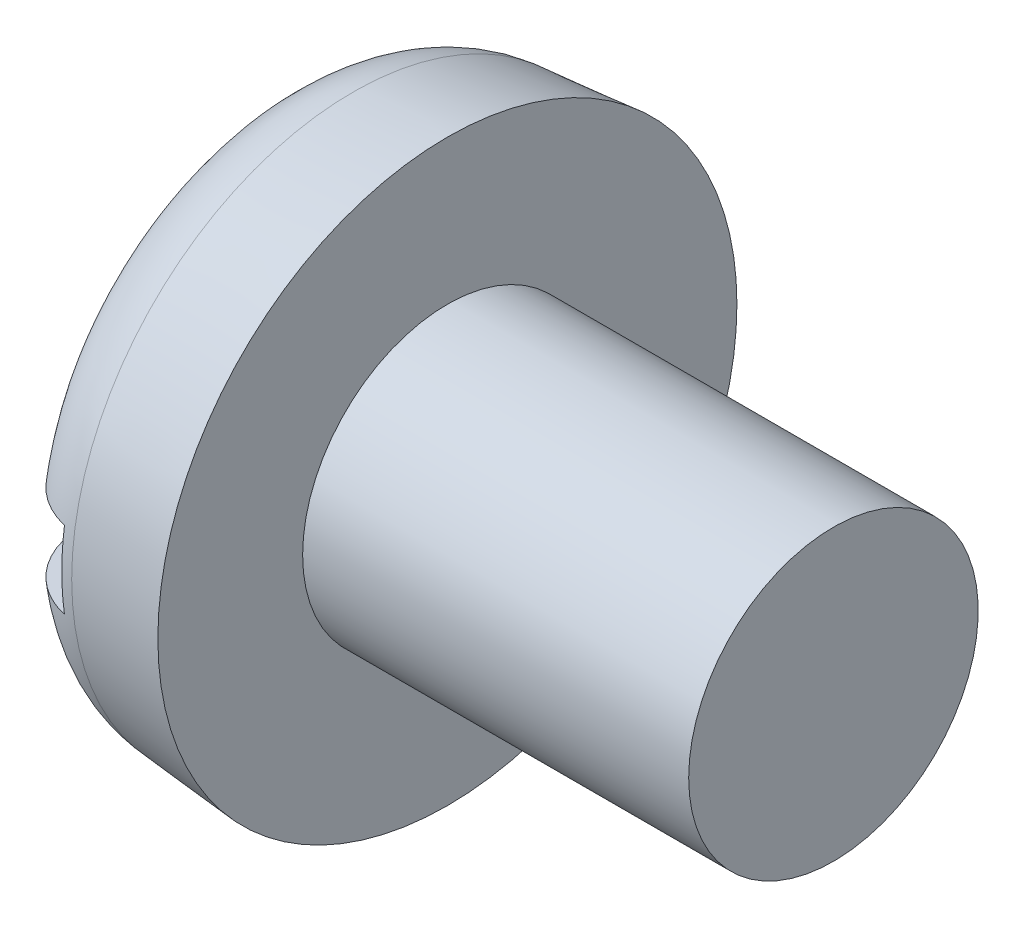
ISO-10303-21;
HEADER;
FILE_DESCRIPTION(('STEP AP214'),'2;1');
FILE_NAME('part.step','',(''),(''),'','','');
FILE_SCHEMA(('AUTOMOTIVE_DESIGN { 1 0 10303 214 1 1 1 1 }'));
ENDSEC;
DATA;
#1=APPLICATION_CONTEXT('core data for automotive mechanical design processes');
#2=APPLICATION_PROTOCOL_DEFINITION('international standard','automotive_design',2000,#1);
#3=PRODUCT_CONTEXT('',#1,'mechanical');
#4=PRODUCT('Part','Part','',(#3));
#5=PRODUCT_RELATED_PRODUCT_CATEGORY('part','',(#4));
#6=PRODUCT_DEFINITION_FORMATION('','',#4);
#7=PRODUCT_DEFINITION_CONTEXT('part definition',#1,'design');
#8=PRODUCT_DEFINITION('design','',#6,#7);
#9=PRODUCT_DEFINITION_SHAPE('','',#8);
#10=(LENGTH_UNIT() NAMED_UNIT(*) SI_UNIT(.MILLI.,.METRE.));
#11=(NAMED_UNIT(*) PLANE_ANGLE_UNIT() SI_UNIT($,.RADIAN.));
#12=(NAMED_UNIT(*) SI_UNIT($,.STERADIAN.) SOLID_ANGLE_UNIT());
#13=UNCERTAINTY_MEASURE_WITH_UNIT(LENGTH_MEASURE(1.E-05),#10,'distance_accuracy_value','');
#14=(GEOMETRIC_REPRESENTATION_CONTEXT(3) GLOBAL_UNCERTAINTY_ASSIGNED_CONTEXT((#13)) GLOBAL_UNIT_ASSIGNED_CONTEXT((#10,
#11,#12)) REPRESENTATION_CONTEXT('',''));
#15=CARTESIAN_POINT('',(0.,0.,0.));
#16=DIRECTION('',(0.,0.,1.));
#17=DIRECTION('',(1.,0.,0.));
#18=AXIS2_PLACEMENT_3D('',#15,#16,#17);
#19=CARTESIAN_POINT('',(0.,0.,0.));
#20=DIRECTION('',(-1.,0.,0.));
#21=DIRECTION('',(0.,0.,1.));
#22=AXIS2_PLACEMENT_3D('',#19,#20,#21);
#23=PLANE('',#22);
#24=DIRECTION('',(0.,0.,-1.));
#25=VECTOR('',#24,1.);
#26=CARTESIAN_POINT('',(0.,0.799999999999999,6.));
#27=LINE('',#26,#25);
#28=CARTESIAN_POINT('',(0.,0.799999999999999,3.9555566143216));
#29=VERTEX_POINT('',#28);
#30=CARTESIAN_POINT('',(0.,0.799999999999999,-3.9555566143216));
#31=VERTEX_POINT('',#30);
#32=EDGE_CURVE('E85',#29,#31,#27,.T.);
#33=ORIENTED_EDGE('',*,*,#32,.F.);
#34=CARTESIAN_POINT('',(0.,0.,0.));
#35=DIRECTION('',(-1.,0.,0.));
#36=DIRECTION('',(0.,0.,1.));
#37=AXIS2_PLACEMENT_3D('',#34,#35,#36);
#38=CIRCLE('',#37,4.03564469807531);
#39=EDGE_CURVE('E91',#29,#31,#38,.T.);
#40=ORIENTED_EDGE('',*,*,#39,.T.);
#41=EDGE_LOOP('',(#33,#40));
#42=FACE_BOUND('',#41,.T.);
#43=ADVANCED_FACE('F32',(#42),#23,.T.);
#44=CARTESIAN_POINT('',(-25.4,0.,0.));
#45=DIRECTION('',(-1.,0.,0.));
#46=DIRECTION('',(0.,0.,1.));
#47=AXIS2_PLACEMENT_3D('',#44,#45,#46);
#48=CYLINDRICAL_SURFACE('',#47,3.);
#49=CARTESIAN_POINT('',(11.6,0.,0.));
#50=DIRECTION('',(-1.,0.,0.));
#51=DIRECTION('',(0.,0.,1.));
#52=AXIS2_PLACEMENT_3D('',#49,#50,#51);
#53=CIRCLE('',#52,3.);
#54=CARTESIAN_POINT('',(11.6,0.,3.));
#55=VERTEX_POINT('',#54);
#56=EDGE_CURVE('E92',#55,#55,#53,.T.);
#57=ORIENTED_EDGE('',*,*,#56,.T.);
#58=EDGE_LOOP('',(#57));
#59=FACE_BOUND('',#58,.T.);
#60=CARTESIAN_POINT('',(3.6,0.,0.));
#61=DIRECTION('',(-1.,0.,0.));
#62=DIRECTION('',(0.,0.,1.));
#63=AXIS2_PLACEMENT_3D('',#60,#61,#62);
#64=CIRCLE('',#63,3.);
#65=CARTESIAN_POINT('',(3.6,0.,3.));
#66=VERTEX_POINT('',#65);
#67=EDGE_CURVE('E149',#66,#66,#64,.T.);
#68=ORIENTED_EDGE('',*,*,#67,.F.);
#69=EDGE_LOOP('',(#68));
#70=FACE_BOUND('',#69,.T.);
#71=ADVANCED_FACE('F137',(#59,#70),#48,.T.);
#72=CARTESIAN_POINT('',(11.6,3.,0.));
#73=DIRECTION('',(1.,0.,0.));
#74=DIRECTION('',(0.,0.,-1.));
#75=AXIS2_PLACEMENT_3D('',#72,#73,#74);
#76=PLANE('',#75);
#77=ORIENTED_EDGE('',*,*,#56,.F.);
#78=EDGE_LOOP('',(#77));
#79=FACE_BOUND('',#78,.T.);
#80=ADVANCED_FACE('F135',(#79),#76,.T.);
#81=DIRECTION('',(0.,0.,1.));
#82=VECTOR('',#81,1.);
#83=CARTESIAN_POINT('',(0.,-0.799999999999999,-6.));
#84=LINE('',#83,#82);
#85=CARTESIAN_POINT('',(0.,-0.799999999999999,-3.9555566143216));
#86=VERTEX_POINT('',#85);
#87=CARTESIAN_POINT('',(0.,-0.800000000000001,3.9555566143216));
#88=VERTEX_POINT('',#87);
#89=EDGE_CURVE('E76',#86,#88,#84,.T.);
#90=ORIENTED_EDGE('',*,*,#89,.F.);
#91=EDGE_CURVE('E83',#86,#88,#38,.T.);
#92=ORIENTED_EDGE('',*,*,#91,.T.);
#93=EDGE_LOOP('',(#90,#92));
#94=FACE_BOUND('',#93,.T.);
#95=ADVANCED_FACE('F82',(#94),#23,.T.);
#96=CARTESIAN_POINT('',(0.,0.,0.));
#97=DIRECTION('',(1.,0.,0.));
#98=DIRECTION('',(0.,0.,-1.));
#99=AXIS2_PLACEMENT_3D('',#96,#97,#98);
#100=CONICAL_SURFACE('',#99,5.68504081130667,0.0872664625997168);
#101=CARTESIAN_POINT('',(1.64311966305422,0.,0.));
#102=DIRECTION('',(-1.,0.,0.));
#103=DIRECTION('',(0.,0.,1.));
#104=AXIS2_PLACEMENT_3D('',#101,#102,#103);
#105=CIRCLE('',#104,5.82879515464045);
#106=CARTESIAN_POINT('',(1.64311966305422,0.,5.82879515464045));
#107=VERTEX_POINT('',#106);
#108=EDGE_CURVE('E95',#107,#107,#105,.F.);
#109=ORIENTED_EDGE('',*,*,#108,.T.);
#110=EDGE_LOOP('',(#109));
#111=FACE_BOUND('',#110,.T.);
#112=CARTESIAN_POINT('',(3.6,0.,0.));
#113=DIRECTION('',(-1.,0.,0.));
#114=DIRECTION('',(0.,0.,1.));
#115=AXIS2_PLACEMENT_3D('',#112,#113,#114);
#116=CIRCLE('',#115,6.);
#117=CARTESIAN_POINT('',(3.6,0.,6.));
#118=VERTEX_POINT('',#117);
#119=EDGE_CURVE('E97',#118,#118,#116,.T.);
#120=ORIENTED_EDGE('',*,*,#119,.T.);
#121=EDGE_LOOP('',(#120));
#122=FACE_BOUND('',#121,.T.);
#123=ADVANCED_FACE('F128',(#111,#122),#100,.T.);
#124=CARTESIAN_POINT('',(3.6,3.,0.));
#125=DIRECTION('',(-1.,0.,0.));
#126=DIRECTION('',(0.,0.,1.));
#127=AXIS2_PLACEMENT_3D('',#124,#125,#126);
#128=PLANE('',#127);
#129=ORIENTED_EDGE('',*,*,#119,.F.);
#130=EDGE_LOOP('',(#129));
#131=FACE_BOUND('',#130,.T.);
#132=ORIENTED_EDGE('',*,*,#67,.T.);
#133=EDGE_LOOP('',(#132));
#134=FACE_BOUND('',#133,.T.);
#135=ADVANCED_FACE('F124',(#131,#134),#128,.F.);
#136=CARTESIAN_POINT('',(1.8,0.,0.));
#137=DIRECTION('',(-1.,0.,0.));
#138=DIRECTION('',(0.,0.,1.));
#139=AXIS2_PLACEMENT_3D('',#136,#137,#138);
#140=TOROIDAL_SURFACE('',#139,4.03564469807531,1.8);
#141=CARTESIAN_POINT('',(0.540762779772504,0.799999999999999,-5.2613759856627));
#142=CARTESIAN_POINT('',(0.612348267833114,0.799999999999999,-5.33226007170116));
#143=CARTESIAN_POINT('',(0.689931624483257,0.799999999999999,-5.3971854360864));
#144=CARTESIAN_POINT('',(0.854947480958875,0.799999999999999,-5.51316161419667));
#145=CARTESIAN_POINT('',(0.94239068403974,0.799999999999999,-5.56419714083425));
#146=CARTESIAN_POINT('',(1.12461220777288,0.799999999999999,-5.650821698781));
#147=CARTESIAN_POINT('',(1.21938917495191,0.799999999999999,-5.6864135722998));
#148=CARTESIAN_POINT('',(1.41356630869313,0.799999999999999,-5.74109194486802));
#149=CARTESIAN_POINT('',(1.51296538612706,0.799999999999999,-5.76018231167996));
#150=CARTESIAN_POINT('',(1.71313899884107,0.799999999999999,-5.78126121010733));
#151=CARTESIAN_POINT('',(1.81390602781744,0.799999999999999,-5.78332104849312));
#152=CARTESIAN_POINT('',(2.01435310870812,0.799999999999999,-5.77046455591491));
#153=CARTESIAN_POINT('',(2.11403314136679,0.799999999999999,-5.75554792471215));
#154=CARTESIAN_POINT('',(2.309314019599,0.799999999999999,-5.70921606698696));
#155=CARTESIAN_POINT('',(2.40492104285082,0.799999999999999,-5.67782686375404));
#156=CARTESIAN_POINT('',(2.58952927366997,0.799999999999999,-5.59948776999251));
#157=CARTESIAN_POINT('',(2.67853045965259,0.799999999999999,-5.55253782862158));
#158=CARTESIAN_POINT('',(2.84769451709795,0.799999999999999,-5.44428887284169));
#159=CARTESIAN_POINT('',(2.92783091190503,0.799999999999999,-5.38294849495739));
#160=CARTESIAN_POINT('',(3.07676159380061,0.799999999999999,-5.24777626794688));
#161=CARTESIAN_POINT('',(3.1455556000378,0.799999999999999,-5.17394410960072));
#162=CARTESIAN_POINT('',(3.27042510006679,0.799999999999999,-5.01531035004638));
#163=CARTESIAN_POINT('',(3.32640120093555,0.799999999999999,-4.93043053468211));
#164=CARTESIAN_POINT('',(3.4235057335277,0.799999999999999,-4.75256933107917));
#165=CARTESIAN_POINT('',(3.46463341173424,0.799999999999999,-4.65958753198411));
#166=CARTESIAN_POINT('',(3.53144158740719,0.799999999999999,-4.46694835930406));
#167=CARTESIAN_POINT('',(3.55692557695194,0.799999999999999,-4.36722286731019));
#168=CARTESIAN_POINT('',(3.59108701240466,0.799999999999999,-4.16493761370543));
#169=CARTESIAN_POINT('',(3.59976314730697,0.799999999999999,-4.06237763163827));
#170=CARTESIAN_POINT('',(3.60023112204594,0.799999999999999,-3.85550711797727));
#171=CARTESIAN_POINT('',(3.59173848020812,0.799999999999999,-3.75119596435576));
#172=CARTESIAN_POINT('',(3.55768438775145,0.799999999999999,-3.54539907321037));
#173=CARTESIAN_POINT('',(3.53212117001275,0.799999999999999,-3.44391362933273));
#174=CARTESIAN_POINT('',(3.46412322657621,0.799999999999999,-3.24471369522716));
#175=CARTESIAN_POINT('',(3.42139292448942,0.799999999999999,-3.14710004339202));
#176=CARTESIAN_POINT('',(3.32030286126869,0.799999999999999,-2.96031799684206));
#177=CARTESIAN_POINT('',(3.26194098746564,0.799999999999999,-2.87115074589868));
#178=CARTESIAN_POINT('',(3.13053846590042,0.799999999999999,-2.70303664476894));
#179=CARTESIAN_POINT('',(3.05736818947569,0.799999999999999,-2.62419095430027));
#180=CARTESIAN_POINT('',(2.89859048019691,0.799999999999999,-2.48017518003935));
#181=CARTESIAN_POINT('',(2.81298317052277,0.799999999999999,-2.41500496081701));
#182=CARTESIAN_POINT('',(2.6334271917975,0.799999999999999,-2.30187272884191));
#183=CARTESIAN_POINT('',(2.53967929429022,0.799999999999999,-2.25359299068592));
#184=CARTESIAN_POINT('',(2.34507363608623,0.799999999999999,-2.17455467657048));
#185=CARTESIAN_POINT('',(2.24421969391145,0.799999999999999,-2.14378676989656));
#186=CARTESIAN_POINT('',(2.04443930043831,0.799999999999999,-2.10254396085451));
#187=CARTESIAN_POINT('',(1.94573097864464,0.799999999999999,-2.09101175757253));
#188=CARTESIAN_POINT('',(1.74783816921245,0.799999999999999,-2.08550669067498));
#189=CARTESIAN_POINT('',(1.64865381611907,0.799999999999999,-2.09152912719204));
#190=CARTESIAN_POINT('',(1.45702700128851,0.799999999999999,-2.12018138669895));
#191=CARTESIAN_POINT('',(1.36447664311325,0.799999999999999,-2.14209986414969));
#192=CARTESIAN_POINT('',(1.18420660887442,0.799999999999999,-2.20075771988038));
#193=CARTESIAN_POINT('',(1.09648771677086,0.799999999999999,-2.23749949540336));
#194=CARTESIAN_POINT('',(0.925723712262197,0.799999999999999,-2.32557805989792));
#195=CARTESIAN_POINT('',(0.842868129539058,0.799999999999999,-2.37728131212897));
#196=CARTESIAN_POINT('',(0.686362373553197,0.799999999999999,-2.493116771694));
#197=CARTESIAN_POINT('',(0.612714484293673,0.799999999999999,-2.55725205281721));
#198=CARTESIAN_POINT('',(0.472161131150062,0.799999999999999,-2.70027682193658));
#199=CARTESIAN_POINT('',(0.405916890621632,0.799999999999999,-2.77981681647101));
#200=CARTESIAN_POINT('',(0.287173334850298,0.799999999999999,-2.9485732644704));
#201=CARTESIAN_POINT('',(0.234676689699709,0.799999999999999,-3.03779159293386));
#202=CARTESIAN_POINT('',(0.143214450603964,0.799999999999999,-3.22677844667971));
#203=CARTESIAN_POINT('',(0.104782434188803,0.799999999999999,-3.32680584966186));
#204=CARTESIAN_POINT('',(0.0452446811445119,0.799999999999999,-3.5318922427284));
#205=CARTESIAN_POINT('',(0.0241387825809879,0.799999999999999,-3.63695118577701));
#206=CARTESIAN_POINT('',(-1.12670491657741E-05,0.799999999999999,-3.84916824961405));
#207=CARTESIAN_POINT('',(-0.00304965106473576,0.799999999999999,-3.95632702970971));
#208=CARTESIAN_POINT('',(0.00921984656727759,0.799999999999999,-4.16962319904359));
#209=CARTESIAN_POINT('',(0.0245310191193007,0.799999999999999,-4.27576040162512));
#210=CARTESIAN_POINT('',(0.0728327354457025,0.799999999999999,-4.48216521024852));
#211=CARTESIAN_POINT('',(0.105541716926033,0.799999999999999,-4.58249883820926));
#212=CARTESIAN_POINT('',(0.187634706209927,0.799999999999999,-4.77599767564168));
#213=CARTESIAN_POINT('',(0.236996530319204,0.799999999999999,-4.86917222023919));
#214=CARTESIAN_POINT('',(0.329466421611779,0.799999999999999,-5.01228034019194));
#215=CARTESIAN_POINT('',(0.367921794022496,0.799999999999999,-5.06527765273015));
#216=CARTESIAN_POINT('',(0.450329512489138,0.799999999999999,-5.16681267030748));
#217=CARTESIAN_POINT('',(0.494281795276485,0.799999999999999,-5.21535042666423));
#218=CARTESIAN_POINT('',(0.540762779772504,0.799999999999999,-5.2613759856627));
#219=B_SPLINE_CURVE_WITH_KNOTS('',3,(#141,#142,#143,#144,#145,#146,#147,#148,#149,#150,#151,
#152,#153,#154,#155,#156,#157,#158,#159,#160,#161,#162,#163,#164,#165,#166,#167,#168,#169,#170,
#171,#172,#173,#174,#175,#176,#177,#178,#179,#180,#181,#182,#183,#184,#185,#186,#187,#188,#189,
#190,#191,#192,#193,#194,#195,#196,#197,#198,#199,#200,#201,#202,#203,#204,#205,#206,#207,#208,
#209,#210,#211,#212,#213,#214,#215,#216,#217,#218),.UNSPECIFIED.,.T.,.F.,(4,2,2,2,2,2,2,2,2,2,2,
2,2,2,2,2,2,2,2,2,2,2,2,2,2,2,2,2,2,2,2,2,2,2,2,2,2,2,4),(0.,0.301990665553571,
0.604312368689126,0.906578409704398,1.20877358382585,1.50970282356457,1.81063738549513,
2.11109795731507,2.41155951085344,2.71289551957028,3.01423898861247,3.31784547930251,
3.6214673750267,3.92882908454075,4.23621476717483,4.54873547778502,4.86128854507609,
5.17947093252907,5.49769634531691,5.81883829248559,6.13997705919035,6.45470120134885,
6.76925749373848,7.06587349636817,7.36241009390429,7.64643650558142,7.93050886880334,
8.22223277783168,8.51402890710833,8.8231740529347,9.13237919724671,9.45232886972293,
9.77227555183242,10.0923243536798,10.4124305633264,10.7275071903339,11.042165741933,
11.2382527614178,11.4343375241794),.UNSPECIFIED.);
#220=CARTESIAN_POINT('',(1.4,0.799999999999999,-5.73510972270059));
#221=VERTEX_POINT('',#220);
#222=EDGE_CURVE('E11',#31,#221,#219,.T.);
#223=ORIENTED_EDGE('',*,*,#222,.F.);
#224=ORIENTED_EDGE('',*,*,#39,.F.);
#225=CARTESIAN_POINT('',(0.836266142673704,0.799999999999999,2.3847675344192));
#226=CARTESIAN_POINT('',(0.917616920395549,0.799999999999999,2.33037611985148));
#227=CARTESIAN_POINT('',(1.00338812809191,0.799999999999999,2.28250940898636));
#228=CARTESIAN_POINT('',(1.18171371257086,0.799999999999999,2.20157945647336));
#229=CARTESIAN_POINT('',(1.27427138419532,0.799999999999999,2.16852346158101));
#230=CARTESIAN_POINT('',(1.46387360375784,0.799999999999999,2.11861651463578));
#231=CARTESIAN_POINT('',(1.56092620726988,0.799999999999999,2.10179593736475));
#232=CARTESIAN_POINT('',(1.75645828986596,0.799999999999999,2.08531619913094));
#233=CARTESIAN_POINT('',(1.85493729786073,0.799999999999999,2.08565149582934));
#234=CARTESIAN_POINT('',(2.04724581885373,0.799999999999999,2.10316628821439));
#235=CARTESIAN_POINT('',(2.1411242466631,0.799999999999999,2.11981673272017));
#236=CARTESIAN_POINT('',(2.32483197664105,0.799999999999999,2.16840533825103));
#237=CARTESIAN_POINT('',(2.41466058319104,0.799999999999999,2.20034611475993));
#238=CARTESIAN_POINT('',(2.58937479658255,0.799999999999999,2.27883470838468));
#239=CARTESIAN_POINT('',(2.67416016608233,0.799999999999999,2.32560484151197));
#240=CARTESIAN_POINT('',(2.83527159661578,0.799999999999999,2.43194790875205));
#241=CARTESIAN_POINT('',(2.91159566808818,0.799999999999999,2.4915238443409));
#242=CARTESIAN_POINT('',(3.05833847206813,0.799999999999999,2.62557742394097));
#243=CARTESIAN_POINT('',(3.12814463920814,0.799999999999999,2.70072607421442));
#244=CARTESIAN_POINT('',(3.25476371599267,0.799999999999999,2.86127427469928));
#245=CARTESIAN_POINT('',(3.31157384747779,0.799999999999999,2.94667601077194));
#246=CARTESIAN_POINT('',(3.41282909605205,0.799999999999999,3.12914373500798));
#247=CARTESIAN_POINT('',(3.4566732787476,0.799999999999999,3.22654397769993));
#248=CARTESIAN_POINT('',(3.52749042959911,0.799999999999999,3.42730182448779));
#249=CARTESIAN_POINT('',(3.55446245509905,0.799999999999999,3.53065976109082));
#250=CARTESIAN_POINT('',(3.59074777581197,0.799999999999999,3.74099682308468));
#251=CARTESIAN_POINT('',(3.59996828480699,0.799999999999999,3.84799201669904));
#252=CARTESIAN_POINT('',(3.60003154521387,0.799999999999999,4.06199242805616));
#253=CARTESIAN_POINT('',(3.59087543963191,0.799999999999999,4.16899764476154));
#254=CARTESIAN_POINT('',(3.5545508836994,0.799999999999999,4.37828946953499));
#255=CARTESIAN_POINT('',(3.5276490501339,0.799999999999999,4.48062230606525));
#256=CARTESIAN_POINT('',(3.45672417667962,0.799999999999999,4.67917518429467));
#257=CARTESIAN_POINT('',(3.41270279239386,0.799999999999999,4.77539581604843));
#258=CARTESIAN_POINT('',(3.30967441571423,0.799999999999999,4.95711293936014));
#259=CARTESIAN_POINT('',(3.2509575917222,0.799999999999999,5.04277397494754));
#260=CARTESIAN_POINT('',(3.11977209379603,0.799999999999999,5.20282644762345));
#261=CARTESIAN_POINT('',(3.04730458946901,0.799999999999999,5.27721884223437));
#262=CARTESIAN_POINT('',(2.89186263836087,0.799999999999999,5.41145672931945));
#263=CARTESIAN_POINT('',(2.80906226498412,0.799999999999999,5.47150384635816));
#264=CARTESIAN_POINT('',(2.63447307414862,0.799999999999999,5.57667826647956));
#265=CARTESIAN_POINT('',(2.54268479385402,0.799999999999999,5.62180646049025));
#266=CARTESIAN_POINT('',(2.35372245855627,0.799999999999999,5.69541178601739));
#267=CARTESIAN_POINT('',(2.25661170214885,0.799999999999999,5.72405148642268));
#268=CARTESIAN_POINT('',(2.05894963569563,0.799999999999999,5.76452632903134));
#269=CARTESIAN_POINT('',(1.95839844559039,0.799999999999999,5.77636205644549));
#270=CARTESIAN_POINT('',(1.75726466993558,0.799999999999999,5.78286013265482));
#271=CARTESIAN_POINT('',(1.65668492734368,0.799999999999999,5.77761084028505));
#272=CARTESIAN_POINT('',(1.45783846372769,0.799999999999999,5.75028865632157));
#273=CARTESIAN_POINT('',(1.35957171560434,0.799999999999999,5.72821596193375));
#274=CARTESIAN_POINT('',(1.16819371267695,0.799999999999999,5.66791633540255));
#275=CARTESIAN_POINT('',(1.07507939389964,0.799999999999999,5.62969912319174));
#276=CARTESIAN_POINT('',(0.896555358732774,0.799999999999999,5.53823241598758));
#277=CARTESIAN_POINT('',(0.811145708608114,0.799999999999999,5.4849827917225));
#278=CARTESIAN_POINT('',(0.650082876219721,0.799999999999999,5.36476593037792));
#279=CARTESIAN_POINT('',(0.574468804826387,0.799999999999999,5.29774630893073));
#280=CARTESIAN_POINT('',(0.435451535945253,0.799999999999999,5.15205983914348));
#281=CARTESIAN_POINT('',(0.372048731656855,0.799999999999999,5.07339261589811));
#282=CARTESIAN_POINT('',(0.258650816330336,0.799999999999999,4.90594446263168));
#283=CARTESIAN_POINT('',(0.208774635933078,0.799999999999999,4.81708301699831));
#284=CARTESIAN_POINT('',(0.124428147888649,0.799999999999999,4.63233098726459));
#285=CARTESIAN_POINT('',(0.0899587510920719,0.799999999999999,4.53643998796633));
#286=CARTESIAN_POINT('',(0.0368868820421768,0.799999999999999,4.33899079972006));
#287=CARTESIAN_POINT('',(0.0185025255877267,0.799999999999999,4.23737401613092));
#288=CARTESIAN_POINT('',(-0.00125734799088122,0.799999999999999,4.03250747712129));
#289=CARTESIAN_POINT('',(-0.00263209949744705,0.799999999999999,3.9292576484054));
#290=CARTESIAN_POINT('',(0.0116307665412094,0.799999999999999,3.72214563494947));
#291=CARTESIAN_POINT('',(0.0275632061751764,0.799999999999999,3.61830377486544));
#292=CARTESIAN_POINT('',(0.0763335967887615,0.799999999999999,3.41464106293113));
#293=CARTESIAN_POINT('',(0.10917724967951,0.799999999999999,3.31482157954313));
#294=CARTESIAN_POINT('',(0.191511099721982,0.799999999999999,3.12021092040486));
#295=CARTESIAN_POINT('',(0.241286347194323,0.799999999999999,3.02554040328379));
#296=CARTESIAN_POINT('',(0.355915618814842,0.799999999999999,2.8458978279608));
#297=CARTESIAN_POINT('',(0.420755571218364,0.799999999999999,2.76091682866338));
#298=CARTESIAN_POINT('',(0.543269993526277,0.799999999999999,2.62572980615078));
#299=CARTESIAN_POINT('',(0.597683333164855,0.799999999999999,2.57253239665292));
#300=CARTESIAN_POINT('',(0.712598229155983,0.799999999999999,2.4731680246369));
#301=CARTESIAN_POINT('',(0.773099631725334,0.799999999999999,2.42700088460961));
#302=CARTESIAN_POINT('',(0.836266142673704,0.799999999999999,2.3847675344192));
#303=B_SPLINE_CURVE_WITH_KNOTS('',3,(#225,#226,#227,#228,#229,#230,#231,#232,#233,#234,#235,
#236,#237,#238,#239,#240,#241,#242,#243,#244,#245,#246,#247,#248,#249,#250,#251,#252,#253,#254,
#255,#256,#257,#258,#259,#260,#261,#262,#263,#264,#265,#266,#267,#268,#269,#270,#271,#272,#273,
#274,#275,#276,#277,#278,#279,#280,#281,#282,#283,#284,#285,#286,#287,#288,#289,#290,#291,#292,
#293,#294,#295,#296,#297,#298,#299,#300,#301,#302),.UNSPECIFIED.,.T.,.F.,(4,2,2,2,2,2,2,2,2,2,2,
2,2,2,2,2,2,2,2,2,2,2,2,2,2,2,2,2,2,2,2,2,2,2,2,2,2,2,4),(0.,0.293321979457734,
0.586787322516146,0.880800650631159,1.17471899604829,1.45941156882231,1.74415285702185,
2.03338255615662,2.32268012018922,2.62901646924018,2.93541824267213,3.25435495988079,
3.57330949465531,3.89392670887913,4.21452398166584,4.53041098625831,4.84626744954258,
5.1563211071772,5.46634840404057,5.77172128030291,6.0770759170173,6.37936593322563,
6.6816454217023,6.98236409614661,7.2830792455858,7.5836136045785,7.88415054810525,
8.18585270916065,8.48756458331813,8.79184901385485,9.09615143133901,9.40451898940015,
9.71290042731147,10.0266186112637,10.3404426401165,10.6598354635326,10.9789311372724,
11.2066928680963,11.43444884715),.UNSPECIFIED.);
#304=CARTESIAN_POINT('',(1.4,0.799999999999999,5.73510972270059));
#305=VERTEX_POINT('',#304);
#306=EDGE_CURVE('E109',#305,#29,#303,.T.);
#307=ORIENTED_EDGE('',*,*,#306,.F.);
#308=CARTESIAN_POINT('',(1.4,0.,0.));
#309=DIRECTION('',(-1.,0.,0.));
#310=DIRECTION('',(0.,0.,1.));
#311=AXIS2_PLACEMENT_3D('',#308,#309,#310);
#312=CIRCLE('',#311,5.79063757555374);
#313=CARTESIAN_POINT('',(1.4,-0.800000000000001,5.73510972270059));
#314=VERTEX_POINT('',#313);
#315=EDGE_CURVE('E103',#305,#314,#312,.F.);
#316=ORIENTED_EDGE('',*,*,#315,.T.);
#317=CARTESIAN_POINT('',(0.836266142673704,-0.8,2.3847675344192));
#318=CARTESIAN_POINT('',(0.748506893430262,-0.8,2.44345191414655));
#319=CARTESIAN_POINT('',(0.665766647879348,-0.8,2.50981960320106));
#320=CARTESIAN_POINT('',(0.512551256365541,-0.8,2.65561376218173));
#321=CARTESIAN_POINT('',(0.442099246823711,-0.8,2.73506432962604));
#322=CARTESIAN_POINT('',(0.315475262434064,-0.8,2.90443495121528));
#323=CARTESIAN_POINT('',(0.259280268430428,-0.8,2.99433778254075));
#324=CARTESIAN_POINT('',(0.162548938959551,-0.8,3.18215299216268));
#325=CARTESIAN_POINT('',(0.122006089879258,-0.8,3.28006201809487));
#326=CARTESIAN_POINT('',(0.0572425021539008,-0.8,3.4827212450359));
#327=CARTESIAN_POINT('',(0.0332676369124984,-0.8,3.58755021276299));
#328=CARTESIAN_POINT('',(0.00342578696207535,-0.8,3.79976969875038));
#329=CARTESIAN_POINT('',(-0.00244009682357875,-0.800000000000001,3.90716037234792));
#330=CARTESIAN_POINT('',(0.00425089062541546,-0.800000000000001,4.12040369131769));
#331=CARTESIAN_POINT('',(0.0166422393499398,-0.800000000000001,4.22626147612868));
#332=CARTESIAN_POINT('',(0.0593599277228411,-0.800000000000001,4.43429705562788));
#333=CARTESIAN_POINT('',(0.0896844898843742,-0.800000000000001,4.53647521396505));
#334=CARTESIAN_POINT('',(0.166811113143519,-0.800000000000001,4.73226366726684));
#335=CARTESIAN_POINT('',(0.21330327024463,-0.800000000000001,4.82599604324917));
#336=CARTESIAN_POINT('',(0.32162267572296,-0.800000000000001,5.00413844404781));
#337=CARTESIAN_POINT('',(0.383448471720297,-0.800000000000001,5.08854935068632));
#338=CARTESIAN_POINT('',(0.519544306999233,-0.800000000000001,5.24416143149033));
#339=CARTESIAN_POINT('',(0.593588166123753,-0.800000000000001,5.31556046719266));
#340=CARTESIAN_POINT('',(0.752739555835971,-0.800000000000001,5.44472836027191));
#341=CARTESIAN_POINT('',(0.837846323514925,-0.800000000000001,5.5024981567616));
#342=CARTESIAN_POINT('',(1.01558854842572,-0.800000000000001,5.60205300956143));
#343=CARTESIAN_POINT('',(1.10812041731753,-0.800000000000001,5.64402306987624));
#344=CARTESIAN_POINT('',(1.29895009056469,-0.800000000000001,5.71170590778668));
#345=CARTESIAN_POINT('',(1.39724763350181,-0.800000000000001,5.7374194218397));
#346=CARTESIAN_POINT('',(1.59606633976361,-0.800000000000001,5.77169733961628));
#347=CARTESIAN_POINT('',(1.69656671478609,-0.800000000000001,5.78038241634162));
#348=CARTESIAN_POINT('',(1.89759433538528,-0.800000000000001,5.78071120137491));
#349=CARTESIAN_POINT('',(1.99812158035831,-0.800000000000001,5.77235526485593));
#350=CARTESIAN_POINT('',(2.19609344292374,-0.800000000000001,5.73889133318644));
#351=CARTESIAN_POINT('',(2.29354498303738,-0.800000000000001,5.71382425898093));
#352=CARTESIAN_POINT('',(2.48286854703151,-0.800000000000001,5.64771711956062));
#353=CARTESIAN_POINT('',(2.57474056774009,-0.800000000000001,5.60667704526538));
#354=CARTESIAN_POINT('',(2.75051258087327,-0.800000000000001,5.50972539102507));
#355=CARTESIAN_POINT('',(2.8343959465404,-0.800000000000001,5.45378367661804));
#356=CARTESIAN_POINT('',(2.99165678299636,-0.800000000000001,5.32869697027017));
#357=CARTESIAN_POINT('',(3.06503402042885,-0.800000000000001,5.25955168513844));
#358=CARTESIAN_POINT('',(3.19973989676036,-0.800000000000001,5.10955333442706));
#359=CARTESIAN_POINT('',(3.26098586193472,-0.800000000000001,5.02862604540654));
#360=CARTESIAN_POINT('',(3.36919753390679,-0.800000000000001,4.85773374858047));
#361=CARTESIAN_POINT('',(3.41616259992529,-0.800000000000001,4.76776833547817));
#362=CARTESIAN_POINT('',(3.49507738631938,-0.800000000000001,4.5802716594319));
#363=CARTESIAN_POINT('',(3.52685014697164,-0.800000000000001,4.48266594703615));
#364=CARTESIAN_POINT('',(3.57383908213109,-0.800000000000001,4.28355151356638));
#365=CARTESIAN_POINT('',(3.58905405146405,-0.800000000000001,4.18204250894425));
#366=CARTESIAN_POINT('',(3.60277332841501,-0.800000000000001,3.97627512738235));
#367=CARTESIAN_POINT('',(3.60100695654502,-0.8,3.87199872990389));
#368=CARTESIAN_POINT('',(3.58032198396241,-0.8,3.66516328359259));
#369=CARTESIAN_POINT('',(3.56140169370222,-0.8,3.56260440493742));
#370=CARTESIAN_POINT('',(3.50655445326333,-0.8,3.3601262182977));
#371=CARTESIAN_POINT('',(3.47032341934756,-0.8,3.26028924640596));
#372=CARTESIAN_POINT('',(3.38182060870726,-0.8,3.06798854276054));
#373=CARTESIAN_POINT('',(3.32954675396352,-0.8,2.97552576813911));
#374=CARTESIAN_POINT('',(3.20964725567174,-0.8,2.79948120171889));
#375=CARTESIAN_POINT('',(3.14184223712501,-0.8,2.71602141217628));
#376=CARTESIAN_POINT('',(2.99302219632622,-0.8,2.56181483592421));
#377=CARTESIAN_POINT('',(2.91200632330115,-0.8,2.49106886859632));
#378=CARTESIAN_POINT('',(2.73997760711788,-0.8,2.36551639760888));
#379=CARTESIAN_POINT('',(2.64910309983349,-0.8,2.31052086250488));
#380=CARTESIAN_POINT('',(2.4590409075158,-0.8,2.21753014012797));
#381=CARTESIAN_POINT('',(2.35985743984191,-0.8,2.17952638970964));
#382=CARTESIAN_POINT('',(2.16147923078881,-0.8,2.12383562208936));
#383=CARTESIAN_POINT('',(2.06255196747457,-0.8,2.10519696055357));
#384=CARTESIAN_POINT('',(1.86294330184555,-0.8,2.08580594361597));
#385=CARTESIAN_POINT('',(1.76226208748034,-0.8,2.08505168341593));
#386=CARTESIAN_POINT('',(1.56749167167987,-0.8,2.1010369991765));
#387=CARTESIAN_POINT('',(1.47332742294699,-0.8,2.11688981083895));
#388=CARTESIAN_POINT('',(1.28901868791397,-0.8,2.16397488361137));
#389=CARTESIAN_POINT('',(1.19886974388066,-0.8,2.19518960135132));
#390=CARTESIAN_POINT('',(1.0638315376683,-0.8,2.25452352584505));
#391=CARTESIAN_POINT('',(1.01673933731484,-0.8,2.27777851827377));
#392=CARTESIAN_POINT('',(0.924773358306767,-0.8,2.32831196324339));
#393=CARTESIAN_POINT('',(0.879899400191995,-0.8,2.35559008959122));
#394=CARTESIAN_POINT('',(0.836266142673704,-0.8,2.3847675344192));
#395=B_SPLINE_CURVE_WITH_KNOTS('',3,(#317,#318,#319,#320,#321,#322,#323,#324,#325,#326,#327,
#328,#329,#330,#331,#332,#333,#334,#335,#336,#337,#338,#339,#340,#341,#342,#343,#344,#345,#346,
#347,#348,#349,#350,#351,#352,#353,#354,#355,#356,#357,#358,#359,#360,#361,#362,#363,#364,#365,
#366,#367,#368,#369,#370,#371,#372,#373,#374,#375,#376,#377,#378,#379,#380,#381,#382,#383,#384,
#385,#386,#387,#388,#389,#390,#391,#392,#393,#394),.UNSPECIFIED.,.T.,.F.,(4,2,2,2,2,2,2,2,2,2,2,
2,2,2,2,2,2,2,2,2,2,2,2,2,2,2,2,2,2,2,2,2,2,2,2,2,2,2,4),(0.,0.316518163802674,
0.633625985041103,0.950218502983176,1.2666791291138,1.58774070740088,1.90882180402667,
2.22700979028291,2.54516624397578,2.8575328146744,3.16986980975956,3.47696670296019,
3.78404242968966,4.08740155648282,4.39074693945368,4.69193476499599,4.99311631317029,
5.29356304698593,5.59400995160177,5.89506910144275,6.19613493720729,6.49918680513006,
6.80225226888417,7.10876667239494,7.41530338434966,7.72673423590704,8.03819576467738,
8.35534173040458,8.6725287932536,8.99358246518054,9.31465682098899,9.63169865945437,
9.94858054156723,10.2490245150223,10.549436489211,10.8345871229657,11.1194128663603,
11.276796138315,11.4341666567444),.UNSPECIFIED.);
#396=EDGE_CURVE('E90',#88,#314,#395,.T.);
#397=ORIENTED_EDGE('',*,*,#396,.F.);
#398=ORIENTED_EDGE('',*,*,#91,.F.);
#399=CARTESIAN_POINT('',(0.540762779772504,-0.799999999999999,-5.2613759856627));
#400=CARTESIAN_POINT('',(0.46800256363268,-0.799999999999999,-5.18931554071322));
#401=CARTESIAN_POINT('',(0.401331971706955,-0.799999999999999,-5.11098969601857));
#402=CARTESIAN_POINT('',(0.282092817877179,-0.799999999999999,-4.94415021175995));
#403=CARTESIAN_POINT('',(0.229543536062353,-0.799999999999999,-4.85562287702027));
#404=CARTESIAN_POINT('',(0.140058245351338,-0.799999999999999,-4.67111833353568));
#405=CARTESIAN_POINT('',(0.103104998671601,-0.799999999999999,-4.57514948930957));
#406=CARTESIAN_POINT('',(0.0456444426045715,-0.799999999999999,-4.37844736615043));
#407=CARTESIAN_POINT('',(0.0251330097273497,-0.799999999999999,-4.27771528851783));
#408=CARTESIAN_POINT('',(0.000807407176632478,-0.799999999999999,-4.07306902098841));
#409=CARTESIAN_POINT('',(-0.00280970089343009,-0.799999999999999,-3.96913144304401));
#410=CARTESIAN_POINT('',(0.00712688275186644,-0.799999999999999,-3.76207815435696));
#411=CARTESIAN_POINT('',(0.0206829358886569,-0.8,-3.65896255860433));
#412=CARTESIAN_POINT('',(0.0648595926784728,-0.8,-3.45448287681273));
#413=CARTESIAN_POINT('',(0.0957869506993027,-0.8,-3.35318504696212));
#414=CARTESIAN_POINT('',(0.173966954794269,-0.8,-3.15709227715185));
#415=CARTESIAN_POINT('',(0.221221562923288,-0.8,-3.06229812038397));
#416=CARTESIAN_POINT('',(0.331523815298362,-0.8,-2.8805427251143));
#417=CARTESIAN_POINT('',(0.394784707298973,-0.8,-2.79371074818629));
#418=CARTESIAN_POINT('',(0.535080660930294,-0.8,-2.63196239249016));
#419=CARTESIAN_POINT('',(0.612117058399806,-0.8,-2.5570471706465));
#420=CARTESIAN_POINT('',(0.777363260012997,-0.8,-2.42207446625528));
#421=CARTESIAN_POINT('',(0.865488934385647,-0.8,-2.36191424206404));
#422=CARTESIAN_POINT('',(1.05097305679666,-0.8,-2.25807126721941));
#423=CARTESIAN_POINT('',(1.1483280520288,-0.8,-2.21438238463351));
#424=CARTESIAN_POINT('',(1.34472607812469,-0.8,-2.14709500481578));
#425=CARTESIAN_POINT('',(1.44348146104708,-0.8,-2.12265879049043));
#426=CARTESIAN_POINT('',(1.64375523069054,-0.8,-2.09184121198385));
#427=CARTESIAN_POINT('',(1.74527230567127,-0.8,-2.08545142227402));
#428=CARTESIAN_POINT('',(1.94205144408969,-0.8,-2.09089422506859));
#429=CARTESIAN_POINT('',(2.03734311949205,-0.8,-2.1017185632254));
#430=CARTESIAN_POINT('',(2.22475371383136,-0.8,-2.1391955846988));
#431=CARTESIAN_POINT('',(2.31687240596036,-0.8,-2.16584939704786));
#432=CARTESIAN_POINT('',(2.49568716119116,-0.8,-2.23389898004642));
#433=CARTESIAN_POINT('',(2.58237134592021,-0.8,-2.27532580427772));
#434=CARTESIAN_POINT('',(2.74807422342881,-0.8,-2.37138684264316));
#435=CARTESIAN_POINT('',(2.82709115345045,-0.8,-2.42602408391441));
#436=CARTESIAN_POINT('',(2.9799165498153,-0.8,-2.55022645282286));
#437=CARTESIAN_POINT('',(3.05318434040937,-0.8,-2.6204569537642));
#438=CARTESIAN_POINT('',(3.18755425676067,-0.8,-2.77172635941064));
#439=CARTESIAN_POINT('',(3.24865355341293,-0.8,-2.85276777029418));
#440=CARTESIAN_POINT('',(3.35979277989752,-0.8,-3.02754470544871));
#441=CARTESIAN_POINT('',(3.40917690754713,-0.8,-3.1216981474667));
#442=CARTESIAN_POINT('',(3.49164209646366,-0.8,-3.31689856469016));
#443=CARTESIAN_POINT('',(3.52472176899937,-0.8,-3.41794612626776));
#444=CARTESIAN_POINT('',(3.57383047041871,-0.8,-3.62528781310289));
#445=CARTESIAN_POINT('',(3.58966846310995,-0.8,-3.73162733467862));
#446=CARTESIAN_POINT('',(3.60302482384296,-0.8,-3.94545563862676));
#447=CARTESIAN_POINT('',(3.60054405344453,-0.799999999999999,-4.05294436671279));
#448=CARTESIAN_POINT('',(3.57730809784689,-0.799999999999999,-4.26456838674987));
#449=CARTESIAN_POINT('',(3.5567824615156,-0.799999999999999,-4.36872882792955));
#450=CARTESIAN_POINT('',(3.49820144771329,-0.799999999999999,-4.57200098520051));
#451=CARTESIAN_POINT('',(3.46014775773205,-0.799999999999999,-4.67111318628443));
#452=CARTESIAN_POINT('',(3.36835841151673,-0.799999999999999,-4.85952398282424));
#453=CARTESIAN_POINT('',(3.31492535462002,-0.799999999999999,-4.94897001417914));
#454=CARTESIAN_POINT('',(3.19357222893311,-0.799999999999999,-5.1174283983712));
#455=CARTESIAN_POINT('',(3.12565341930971,-0.799999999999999,-5.196441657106));
#456=CARTESIAN_POINT('',(2.97843308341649,-0.799999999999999,-5.34047951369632));
#457=CARTESIAN_POINT('',(2.89932889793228,-0.799999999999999,-5.40570586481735));
#458=CARTESIAN_POINT('',(2.73119091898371,-0.799999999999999,-5.52177624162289));
#459=CARTESIAN_POINT('',(2.64215774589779,-0.799999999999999,-5.57262116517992));
#460=CARTESIAN_POINT('',(2.45774484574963,-0.799999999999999,-5.65792437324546));
#461=CARTESIAN_POINT('',(2.36244515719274,-0.799999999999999,-5.69255575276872));
#462=CARTESIAN_POINT('',(2.16736859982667,-0.799999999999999,-5.7452167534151));
#463=CARTESIAN_POINT('',(2.06759209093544,-0.799999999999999,-5.76324770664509));
#464=CARTESIAN_POINT('',(1.8670464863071,-0.799999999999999,-5.78211504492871));
#465=CARTESIAN_POINT('',(1.76628722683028,-0.799999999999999,-5.78305617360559));
#466=CARTESIAN_POINT('',(1.56601778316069,-0.799999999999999,-5.76798048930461));
#467=CARTESIAN_POINT('',(1.46650790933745,-0.799999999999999,-5.75195954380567));
#468=CARTESIAN_POINT('',(1.27169371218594,-0.799999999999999,-5.70345798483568));
#469=CARTESIAN_POINT('',(1.17638560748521,-0.799999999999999,-5.67099251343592));
#470=CARTESIAN_POINT('',(0.992639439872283,-0.799999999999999,-5.59058259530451));
#471=CARTESIAN_POINT('',(0.904192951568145,-0.799999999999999,-5.54265751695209));
#472=CARTESIAN_POINT('',(0.770167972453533,-0.799999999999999,-5.45480755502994));
#473=CARTESIAN_POINT('',(0.72159797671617,-0.799999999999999,-5.41935523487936));
#474=CARTESIAN_POINT('',(0.628240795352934,-0.799999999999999,-5.34377955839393));
#475=CARTESIAN_POINT('',(0.583453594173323,-0.799999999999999,-5.30365622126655));
#476=CARTESIAN_POINT('',(0.540762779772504,-0.799999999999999,-5.2613759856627));
#477=B_SPLINE_CURVE_WITH_KNOTS('',3,(#399,#400,#401,#402,#403,#404,#405,#406,#407,#408,#409,
#410,#411,#412,#413,#414,#415,#416,#417,#418,#419,#420,#421,#422,#423,#424,#425,#426,#427,#428,
#429,#430,#431,#432,#433,#434,#435,#436,#437,#438,#439,#440,#441,#442,#443,#444,#445,#446,#447,
#448,#449,#450,#451,#452,#453,#454,#455,#456,#457,#458,#459,#460,#461,#462,#463,#464,#465,#466,
#467,#468,#469,#470,#471,#472,#473,#474,#475,#476),.UNSPECIFIED.,.T.,.F.,(4,2,2,2,2,2,2,2,2,2,2,
2,2,2,2,2,2,2,2,2,2,2,2,2,2,2,2,2,2,2,2,2,2,2,2,2,2,2,4),(0.,0.306991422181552,0.61439988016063,
0.921467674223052,1.22845843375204,1.53902124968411,1.84962677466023,2.1658978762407,
2.48220699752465,2.80297521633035,3.12377455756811,3.4422723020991,3.76065135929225,
4.06426589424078,4.36773865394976,4.65408102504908,4.94044382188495,5.22741215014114,
5.51444629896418,5.81757894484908,6.12078198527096,6.43825439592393,6.75575384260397,
7.07673643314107,7.39770392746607,7.71464653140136,8.03155862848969,8.34261788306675,
8.65365010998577,8.95975564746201,9.2658420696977,9.56858170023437,9.87129703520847,
10.1721563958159,10.4730890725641,10.7737451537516,11.0740260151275,11.254148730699,
11.4342707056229),.UNSPECIFIED.);
#478=CARTESIAN_POINT('',(1.4,-0.799999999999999,-5.73510972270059));
#479=VERTEX_POINT('',#478);
#480=EDGE_CURVE('E44',#479,#86,#477,.T.);
#481=ORIENTED_EDGE('',*,*,#480,.F.);
#482=EDGE_CURVE('E56',#479,#221,#312,.F.);
#483=ORIENTED_EDGE('',*,*,#482,.T.);
#484=EDGE_LOOP('',(#223,#224,#307,#316,#397,#398,#481,#483));
#485=FACE_BOUND('',#484,.T.);
#486=ORIENTED_EDGE('',*,*,#108,.F.);
#487=EDGE_LOOP('',(#486));
#488=FACE_BOUND('',#487,.T.);
#489=ADVANCED_FACE('F34',(#485,#488),#140,.T.);
#490=CARTESIAN_POINT('',(1.4,0.799999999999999,6.));
#491=DIRECTION('',(0.,1.,0.));
#492=DIRECTION('',(0.,0.,1.));
#493=AXIS2_PLACEMENT_3D('',#490,#491,#492);
#494=PLANE('',#493);
#495=ORIENTED_EDGE('',*,*,#222,.T.);
#496=DIRECTION('',(0.,0.,-1.));
#497=VECTOR('',#496,1.);
#498=CARTESIAN_POINT('',(1.4,0.799999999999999,6.));
#499=LINE('',#498,#497);
#500=EDGE_CURVE('E84',#305,#221,#499,.T.);
#501=ORIENTED_EDGE('',*,*,#500,.F.);
#502=ORIENTED_EDGE('',*,*,#306,.T.);
#503=ORIENTED_EDGE('',*,*,#32,.T.);
#504=EDGE_LOOP('',(#495,#501,#502,#503));
#505=FACE_BOUND('',#504,.T.);
#506=ADVANCED_FACE('F116',(#505),#494,.F.);
#507=CARTESIAN_POINT('',(1.4,-0.799999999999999,-6.));
#508=DIRECTION('',(0.,-1.,0.));
#509=DIRECTION('',(0.,0.,-1.));
#510=AXIS2_PLACEMENT_3D('',#507,#508,#509);
#511=PLANE('',#510);
#512=ORIENTED_EDGE('',*,*,#480,.T.);
#513=ORIENTED_EDGE('',*,*,#89,.T.);
#514=ORIENTED_EDGE('',*,*,#396,.T.);
#515=DIRECTION('',(0.,0.,1.));
#516=VECTOR('',#515,1.);
#517=CARTESIAN_POINT('',(1.4,-0.799999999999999,-6.));
#518=LINE('',#517,#516);
#519=EDGE_CURVE('E51',#479,#314,#518,.T.);
#520=ORIENTED_EDGE('',*,*,#519,.F.);
#521=EDGE_LOOP('',(#512,#513,#514,#520));
#522=FACE_BOUND('',#521,.T.);
#523=ADVANCED_FACE('F75',(#522),#511,.F.);
#524=CARTESIAN_POINT('',(1.4,0.799999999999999,-6.));
#525=DIRECTION('',(-1.,0.,0.));
#526=DIRECTION('',(0.,0.,1.));
#527=AXIS2_PLACEMENT_3D('',#524,#525,#526);
#528=PLANE('',#527);
#529=ORIENTED_EDGE('',*,*,#519,.T.);
#530=ORIENTED_EDGE('',*,*,#315,.F.);
#531=ORIENTED_EDGE('',*,*,#500,.T.);
#532=ORIENTED_EDGE('',*,*,#482,.F.);
#533=EDGE_LOOP('',(#529,#530,#531,#532));
#534=FACE_BOUND('',#533,.T.);
#535=ADVANCED_FACE('F115',(#534),#528,.T.);
#536=CLOSED_SHELL('',(#43,#71,#80,#95,#123,#135,#489,#506,#523,#535));
#537=MANIFOLD_SOLID_BREP('B2',#536);
#538=ADVANCED_BREP_SHAPE_REPRESENTATION('',(#18,#537),#14);
#539=SHAPE_DEFINITION_REPRESENTATION(#9,#538);
ENDSEC;
END-ISO-10303-21;
